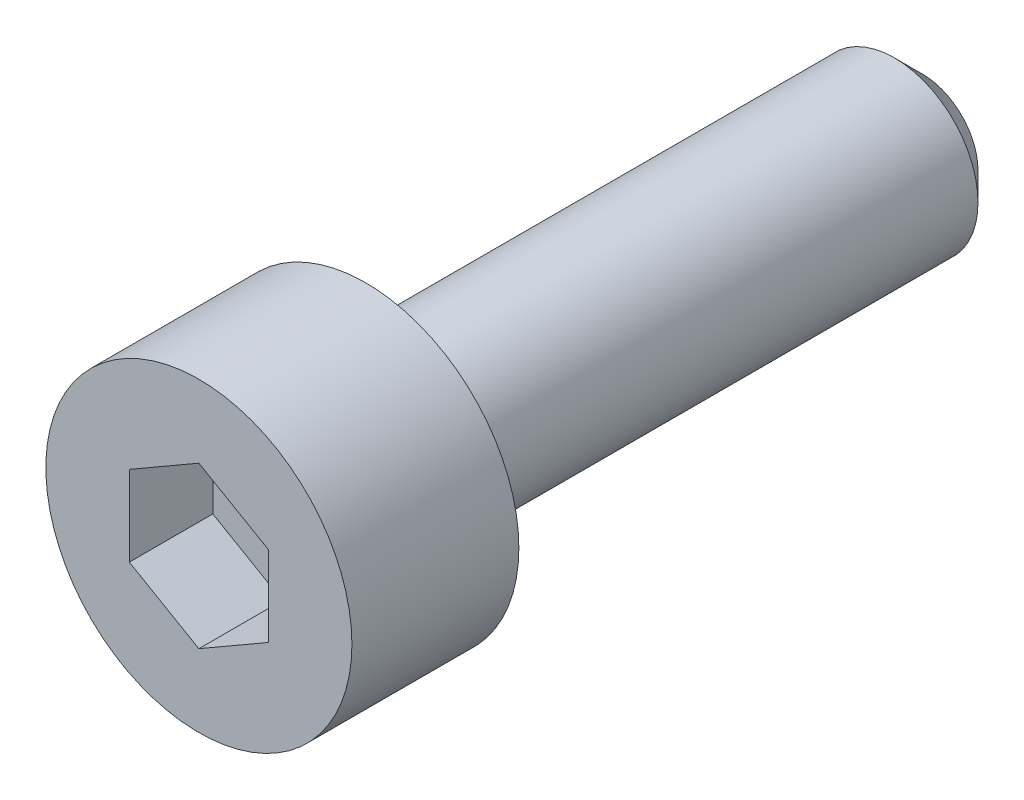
ISO-10303-21;
HEADER;
FILE_DESCRIPTION(('STEP AP214'),'2;1');
FILE_NAME('part.step','',(''),(''),'','','');
FILE_SCHEMA(('AUTOMOTIVE_DESIGN { 1 0 10303 214 1 1 1 1 }'));
ENDSEC;
DATA;
#1=APPLICATION_CONTEXT('core data for automotive mechanical design processes');
#2=APPLICATION_PROTOCOL_DEFINITION('international standard','automotive_design',2000,#1);
#3=PRODUCT_CONTEXT('',#1,'mechanical');
#4=PRODUCT('Part','Part','',(#3));
#5=PRODUCT_RELATED_PRODUCT_CATEGORY('part','',(#4));
#6=PRODUCT_DEFINITION_FORMATION('','',#4);
#7=PRODUCT_DEFINITION_CONTEXT('part definition',#1,'design');
#8=PRODUCT_DEFINITION('design','',#6,#7);
#9=PRODUCT_DEFINITION_SHAPE('','',#8);
#10=(LENGTH_UNIT() NAMED_UNIT(*) SI_UNIT(.MILLI.,.METRE.));
#11=(NAMED_UNIT(*) PLANE_ANGLE_UNIT() SI_UNIT($,.RADIAN.));
#12=(NAMED_UNIT(*) SI_UNIT($,.STERADIAN.) SOLID_ANGLE_UNIT());
#13=UNCERTAINTY_MEASURE_WITH_UNIT(LENGTH_MEASURE(1.E-05),#10,'distance_accuracy_value','');
#14=(GEOMETRIC_REPRESENTATION_CONTEXT(3) GLOBAL_UNCERTAINTY_ASSIGNED_CONTEXT((#13)) GLOBAL_UNIT_ASSIGNED_CONTEXT((#10,
#11,#12)) REPRESENTATION_CONTEXT('',''));
#15=CARTESIAN_POINT('',(0.,0.,0.));
#16=DIRECTION('',(0.,0.,1.));
#17=DIRECTION('',(1.,0.,0.));
#18=AXIS2_PLACEMENT_3D('',#15,#16,#17);
#19=CARTESIAN_POINT('',(0.,1.44337567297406,1.5));
#20=DIRECTION('',(-0.5,-0.866025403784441,0.));
#21=DIRECTION('',(0.866025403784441,-0.5,0.));
#22=AXIS2_PLACEMENT_3D('',#19,#20,#21);
#23=PLANE('',#22);
#24=DIRECTION('',(0.,0.,1.));
#25=VECTOR('',#24,1.);
#26=CARTESIAN_POINT('',(1.25,0.721687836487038,1.5));
#27=LINE('',#26,#25);
#28=CARTESIAN_POINT('',(1.25,0.721687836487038,1.5));
#29=VERTEX_POINT('',#28);
#30=CARTESIAN_POINT('',(1.24999999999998,0.721687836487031,2.99999999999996));
#31=VERTEX_POINT('',#30);
#32=EDGE_CURVE('E63',#29,#31,#27,.T.);
#33=ORIENTED_EDGE('',*,*,#32,.T.);
#34=DIRECTION('',(0.86602540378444,-0.5,0.));
#35=VECTOR('',#34,1.);
#36=CARTESIAN_POINT('',(0.,1.44337567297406,2.99999999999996));
#37=LINE('',#36,#35);
#38=CARTESIAN_POINT('',(0.,1.44337567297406,2.99999999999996));
#39=VERTEX_POINT('',#38);
#40=EDGE_CURVE('E29',#39,#31,#37,.T.);
#41=ORIENTED_EDGE('',*,*,#40,.F.);
#42=DIRECTION('',(0.,0.,1.));
#43=VECTOR('',#42,1.);
#44=CARTESIAN_POINT('',(0.,1.44337567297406,1.5));
#45=LINE('',#44,#43);
#46=CARTESIAN_POINT('',(0.,1.44337567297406,1.5));
#47=VERTEX_POINT('',#46);
#48=EDGE_CURVE('E33',#47,#39,#45,.T.);
#49=ORIENTED_EDGE('',*,*,#48,.F.);
#50=DIRECTION('',(0.86602540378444,-0.5,0.));
#51=VECTOR('',#50,1.);
#52=CARTESIAN_POINT('',(0.,1.44337567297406,1.5));
#53=LINE('',#52,#51);
#54=EDGE_CURVE('E65',#47,#29,#53,.T.);
#55=ORIENTED_EDGE('',*,*,#54,.T.);
#56=EDGE_LOOP('',(#33,#41,#49,#55));
#57=FACE_BOUND('',#56,.T.);
#58=ADVANCED_FACE('F14',(#57),#23,.T.);
#59=CARTESIAN_POINT('',(1.25,-0.721687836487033,1.49999999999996));
#60=DIRECTION('',(1.,0.,0.));
#61=DIRECTION('',(0.,1.,0.));
#62=AXIS2_PLACEMENT_3D('',#59,#60,#61);
#63=PLANE('',#62);
#64=DIRECTION('',(0.,0.,1.));
#65=VECTOR('',#64,1.);
#66=CARTESIAN_POINT('',(1.25,-0.721687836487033,1.49999999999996));
#67=LINE('',#66,#65);
#68=CARTESIAN_POINT('',(1.25,-0.721687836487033,1.49999999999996));
#69=VERTEX_POINT('',#68);
#70=CARTESIAN_POINT('',(1.25,-0.72168783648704,2.99999999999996));
#71=VERTEX_POINT('',#70);
#72=EDGE_CURVE('E70',#69,#71,#67,.T.);
#73=ORIENTED_EDGE('',*,*,#72,.T.);
#74=DIRECTION('',(0.,1.,0.));
#75=VECTOR('',#74,1.);
#76=CARTESIAN_POINT('',(1.25,-0.72168783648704,2.99999999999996));
#77=LINE('',#76,#75);
#78=EDGE_CURVE('E73',#71,#31,#77,.T.);
#79=ORIENTED_EDGE('',*,*,#78,.T.);
#80=ORIENTED_EDGE('',*,*,#32,.F.);
#81=DIRECTION('',(0.,1.,0.));
#82=VECTOR('',#81,1.);
#83=CARTESIAN_POINT('',(1.25,-0.721687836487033,1.49999999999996));
#84=LINE('',#83,#82);
#85=EDGE_CURVE('E100',#69,#29,#84,.T.);
#86=ORIENTED_EDGE('',*,*,#85,.F.);
#87=EDGE_LOOP('',(#73,#79,#80,#86));
#88=FACE_BOUND('',#87,.T.);
#89=ADVANCED_FACE('F74',(#88),#63,.F.);
#90=CARTESIAN_POINT('',(0.,-1.44337567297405,1.49999999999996));
#91=DIRECTION('',(0.5,-0.866025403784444,0.));
#92=DIRECTION('',(0.866025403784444,0.5,0.));
#93=AXIS2_PLACEMENT_3D('',#90,#91,#92);
#94=PLANE('',#93);
#95=DIRECTION('',(0.,0.,1.));
#96=VECTOR('',#95,1.);
#97=CARTESIAN_POINT('',(0.,-1.44337567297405,1.49999999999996));
#98=LINE('',#97,#96);
#99=CARTESIAN_POINT('',(0.,-1.44337567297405,1.49999999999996));
#100=VERTEX_POINT('',#99);
#101=CARTESIAN_POINT('',(0.,-1.44337567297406,2.99999999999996));
#102=VERTEX_POINT('',#101);
#103=EDGE_CURVE('E108',#100,#102,#98,.T.);
#104=ORIENTED_EDGE('',*,*,#103,.T.);
#105=DIRECTION('',(0.866025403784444,0.5,0.));
#106=VECTOR('',#105,1.);
#107=CARTESIAN_POINT('',(0.,-1.44337567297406,2.99999999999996));
#108=LINE('',#107,#106);
#109=EDGE_CURVE('E78',#102,#71,#108,.T.);
#110=ORIENTED_EDGE('',*,*,#109,.T.);
#111=ORIENTED_EDGE('',*,*,#72,.F.);
#112=DIRECTION('',(0.866025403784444,0.5,0.));
#113=VECTOR('',#112,1.);
#114=CARTESIAN_POINT('',(0.,-1.44337567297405,1.49999999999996));
#115=LINE('',#114,#113);
#116=EDGE_CURVE('E97',#100,#69,#115,.T.);
#117=ORIENTED_EDGE('',*,*,#116,.F.);
#118=EDGE_LOOP('',(#104,#110,#111,#117));
#119=FACE_BOUND('',#118,.T.);
#120=ADVANCED_FACE('F139',(#119),#94,.F.);
#121=CARTESIAN_POINT('',(0.,-1.44337567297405,1.49999999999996));
#122=DIRECTION('',(0.5,0.866025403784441,0.));
#123=DIRECTION('',(-0.866025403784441,0.5,0.));
#124=AXIS2_PLACEMENT_3D('',#121,#122,#123);
#125=PLANE('',#124);
#126=DIRECTION('',(0.,0.,1.));
#127=VECTOR('',#126,1.);
#128=CARTESIAN_POINT('',(-1.25,-0.721687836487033,1.49999999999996));
#129=LINE('',#128,#127);
#130=CARTESIAN_POINT('',(-1.25,-0.721687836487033,1.49999999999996));
#131=VERTEX_POINT('',#130);
#132=CARTESIAN_POINT('',(-1.25000000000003,-0.721687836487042,2.99999999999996));
#133=VERTEX_POINT('',#132);
#134=EDGE_CURVE('E106',#131,#133,#129,.T.);
#135=ORIENTED_EDGE('',*,*,#134,.T.);
#136=DIRECTION('',(-0.866025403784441,0.5,0.));
#137=VECTOR('',#136,1.);
#138=CARTESIAN_POINT('',(0.,-1.44337567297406,2.99999999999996));
#139=LINE('',#138,#137);
#140=EDGE_CURVE('E188',#102,#133,#139,.T.);
#141=ORIENTED_EDGE('',*,*,#140,.F.);
#142=ORIENTED_EDGE('',*,*,#103,.F.);
#143=DIRECTION('',(-0.866025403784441,0.5,0.));
#144=VECTOR('',#143,1.);
#145=CARTESIAN_POINT('',(0.,-1.44337567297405,1.49999999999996));
#146=LINE('',#145,#144);
#147=EDGE_CURVE('E94',#100,#131,#146,.T.);
#148=ORIENTED_EDGE('',*,*,#147,.T.);
#149=EDGE_LOOP('',(#135,#141,#142,#148));
#150=FACE_BOUND('',#149,.T.);
#151=ADVANCED_FACE('F151',(#150),#125,.T.);
#152=CARTESIAN_POINT('',(-1.25000000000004,0.721687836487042,1.5));
#153=DIRECTION('',(-1.,0.,0.));
#154=DIRECTION('',(0.,-1.,0.));
#155=AXIS2_PLACEMENT_3D('',#152,#153,#154);
#156=PLANE('',#155);
#157=DIRECTION('',(0.,0.,1.));
#158=VECTOR('',#157,1.);
#159=CARTESIAN_POINT('',(-1.25000000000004,0.721687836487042,1.5));
#160=LINE('',#159,#158);
#161=CARTESIAN_POINT('',(-1.25000000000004,0.721687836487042,1.5));
#162=VERTEX_POINT('',#161);
#163=CARTESIAN_POINT('',(-1.25000000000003,0.721687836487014,2.99999999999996));
#164=VERTEX_POINT('',#163);
#165=EDGE_CURVE('E104',#162,#164,#160,.T.);
#166=ORIENTED_EDGE('',*,*,#165,.T.);
#167=DIRECTION('',(0.,-1.,0.));
#168=VECTOR('',#167,1.);
#169=CARTESIAN_POINT('',(-1.25000000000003,0.721687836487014,2.99999999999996));
#170=LINE('',#169,#168);
#171=EDGE_CURVE('E189',#164,#133,#170,.T.);
#172=ORIENTED_EDGE('',*,*,#171,.T.);
#173=ORIENTED_EDGE('',*,*,#134,.F.);
#174=DIRECTION('',(0.,-1.,0.));
#175=VECTOR('',#174,1.);
#176=CARTESIAN_POINT('',(-1.25000000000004,0.721687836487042,1.5));
#177=LINE('',#176,#175);
#178=EDGE_CURVE('E91',#162,#131,#177,.T.);
#179=ORIENTED_EDGE('',*,*,#178,.F.);
#180=EDGE_LOOP('',(#166,#172,#173,#179));
#181=FACE_BOUND('',#180,.T.);
#182=ADVANCED_FACE('F147',(#181),#156,.F.);
#183=CARTESIAN_POINT('',(0.,1.44337567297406,1.5));
#184=DIRECTION('',(-0.5,0.866025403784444,0.));
#185=DIRECTION('',(-0.866025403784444,-0.5,0.));
#186=AXIS2_PLACEMENT_3D('',#183,#184,#185);
#187=PLANE('',#186);
#188=DIRECTION('',(-0.866025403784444,-0.5,0.));
#189=VECTOR('',#188,1.);
#190=CARTESIAN_POINT('',(0.,1.44337567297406,1.5));
#191=LINE('',#190,#189);
#192=EDGE_CURVE('E88',#47,#162,#191,.T.);
#193=ORIENTED_EDGE('',*,*,#192,.F.);
#194=ORIENTED_EDGE('',*,*,#48,.T.);
#195=DIRECTION('',(-0.866025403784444,-0.5,0.));
#196=VECTOR('',#195,1.);
#197=CARTESIAN_POINT('',(0.,1.44337567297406,2.99999999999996));
#198=LINE('',#197,#196);
#199=EDGE_CURVE('E84',#39,#164,#198,.T.);
#200=ORIENTED_EDGE('',*,*,#199,.T.);
#201=ORIENTED_EDGE('',*,*,#165,.F.);
#202=EDGE_LOOP('',(#193,#194,#200,#201));
#203=FACE_BOUND('',#202,.T.);
#204=ADVANCED_FACE('F144',(#203),#187,.F.);
#205=CARTESIAN_POINT('',(1.25,0.721687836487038,1.5));
#206=DIRECTION('',(0.,0.,1.));
#207=DIRECTION('',(1.,0.,0.));
#208=AXIS2_PLACEMENT_3D('',#205,#206,#207);
#209=PLANE('',#208);
#210=ORIENTED_EDGE('',*,*,#54,.F.);
#211=ORIENTED_EDGE('',*,*,#192,.T.);
#212=ORIENTED_EDGE('',*,*,#178,.T.);
#213=ORIENTED_EDGE('',*,*,#147,.F.);
#214=ORIENTED_EDGE('',*,*,#116,.T.);
#215=ORIENTED_EDGE('',*,*,#85,.T.);
#216=EDGE_LOOP('',(#210,#211,#212,#213,#214,#215));
#217=FACE_BOUND('',#216,.T.);
#218=ADVANCED_FACE('F143',(#217),#209,.T.);
#219=CARTESIAN_POINT('',(0.,0.,2.99999999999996));
#220=DIRECTION('',(0.,0.,1.));
#221=DIRECTION('',(1.,0.,0.));
#222=AXIS2_PLACEMENT_3D('',#219,#220,#221);
#223=PLANE('',#222);
#224=CARTESIAN_POINT('',(0.,0.,2.99999999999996));
#225=DIRECTION('',(0.,0.,1.));
#226=DIRECTION('',(1.,0.,0.));
#227=AXIS2_PLACEMENT_3D('',#224,#225,#226);
#228=CIRCLE('',#227,2.75);
#229=CARTESIAN_POINT('',(2.75,0.,2.99999999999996));
#230=VERTEX_POINT('',#229);
#231=EDGE_CURVE('E116',#230,#230,#228,.T.);
#232=ORIENTED_EDGE('',*,*,#231,.T.);
#233=EDGE_LOOP('',(#232));
#234=FACE_BOUND('',#233,.T.);
#235=ORIENTED_EDGE('',*,*,#199,.F.);
#236=ORIENTED_EDGE('',*,*,#40,.T.);
#237=ORIENTED_EDGE('',*,*,#78,.F.);
#238=ORIENTED_EDGE('',*,*,#109,.F.);
#239=ORIENTED_EDGE('',*,*,#140,.T.);
#240=ORIENTED_EDGE('',*,*,#171,.F.);
#241=EDGE_LOOP('',(#235,#236,#237,#238,#239,#240));
#242=FACE_BOUND('',#241,.T.);
#243=ADVANCED_FACE('F81',(#234,#242),#223,.T.);
#244=CARTESIAN_POINT('',(0.,0.,13.9999999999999));
#245=DIRECTION('',(0.,0.,1.));
#246=DIRECTION('',(1.,0.,0.));
#247=AXIS2_PLACEMENT_3D('',#244,#245,#246);
#248=CYLINDRICAL_SURFACE('',#247,2.75);
#249=CARTESIAN_POINT('',(0.,0.,0.));
#250=DIRECTION('',(0.,0.,1.));
#251=DIRECTION('',(1.,0.,0.));
#252=AXIS2_PLACEMENT_3D('',#249,#250,#251);
#253=CIRCLE('',#252,2.75);
#254=CARTESIAN_POINT('',(2.75,0.,0.));
#255=VERTEX_POINT('',#254);
#256=EDGE_CURVE('E113',#255,#255,#253,.T.);
#257=ORIENTED_EDGE('',*,*,#256,.T.);
#258=EDGE_LOOP('',(#257));
#259=FACE_BOUND('',#258,.T.);
#260=ORIENTED_EDGE('',*,*,#231,.F.);
#261=EDGE_LOOP('',(#260));
#262=FACE_BOUND('',#261,.T.);
#263=ADVANCED_FACE('F165',(#259,#262),#248,.T.);
#264=CARTESIAN_POINT('',(2.75,0.,0.));
#265=DIRECTION('',(0.,0.,-1.));
#266=DIRECTION('',(-1.,0.,0.));
#267=AXIS2_PLACEMENT_3D('',#264,#265,#266);
#268=PLANE('',#267);
#269=CARTESIAN_POINT('',(0.,0.,0.));
#270=DIRECTION('',(0.,0.,1.));
#271=DIRECTION('',(1.,0.,0.));
#272=AXIS2_PLACEMENT_3D('',#269,#270,#271);
#273=CIRCLE('',#272,1.5);
#274=CARTESIAN_POINT('',(1.5,0.,0.));
#275=VERTEX_POINT('',#274);
#276=EDGE_CURVE('E69',#275,#275,#273,.T.);
#277=ORIENTED_EDGE('',*,*,#276,.T.);
#278=EDGE_LOOP('',(#277));
#279=FACE_BOUND('',#278,.T.);
#280=ORIENTED_EDGE('',*,*,#256,.F.);
#281=EDGE_LOOP('',(#280));
#282=FACE_BOUND('',#281,.T.);
#283=ADVANCED_FACE('F161',(#279,#282),#268,.T.);
#284=CARTESIAN_POINT('',(0.,0.,13.9999999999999));
#285=DIRECTION('',(0.,0.,1.));
#286=DIRECTION('',(1.,0.,0.));
#287=AXIS2_PLACEMENT_3D('',#284,#285,#286);
#288=CYLINDRICAL_SURFACE('',#287,1.5);
#289=CARTESIAN_POINT('',(0.,0.,-9.5));
#290=DIRECTION('',(0.,0.,-1.));
#291=DIRECTION('',(-1.,0.,0.));
#292=AXIS2_PLACEMENT_3D('',#289,#290,#291);
#293=CIRCLE('',#292,1.5);
#294=CARTESIAN_POINT('',(-1.50000000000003,0.,-9.5));
#295=VERTEX_POINT('',#294);
#296=EDGE_CURVE('E9',#295,#295,#293,.F.);
#297=ORIENTED_EDGE('',*,*,#296,.T.);
#298=EDGE_LOOP('',(#297));
#299=FACE_BOUND('',#298,.T.);
#300=ORIENTED_EDGE('',*,*,#276,.F.);
#301=EDGE_LOOP('',(#300));
#302=FACE_BOUND('',#301,.T.);
#303=ADVANCED_FACE('F130',(#299,#302),#288,.T.);
#304=CARTESIAN_POINT('',(0.,0.,-10.));
#305=DIRECTION('',(0.,0.,-1.));
#306=DIRECTION('',(0.,1.,0.));
#307=AXIS2_PLACEMENT_3D('',#304,#305,#306);
#308=PLANE('',#307);
#309=CARTESIAN_POINT('',(0.,0.,-10.));
#310=DIRECTION('',(0.,0.,-1.));
#311=DIRECTION('',(0.,1.,0.));
#312=AXIS2_PLACEMENT_3D('',#309,#310,#311);
#313=CIRCLE('',#312,0.999999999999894);
#314=CARTESIAN_POINT('',(0.,0.999999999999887,-10.));
#315=VERTEX_POINT('',#314);
#316=EDGE_CURVE('E22',#315,#315,#313,.T.);
#317=ORIENTED_EDGE('',*,*,#316,.T.);
#318=EDGE_LOOP('',(#317));
#319=FACE_BOUND('',#318,.T.);
#320=ADVANCED_FACE('F121',(#319),#308,.T.);
#321=CARTESIAN_POINT('',(0.,0.,-10.));
#322=DIRECTION('',(0.,0.,1.));
#323=DIRECTION('',(1.,0.,0.));
#324=AXIS2_PLACEMENT_3D('',#321,#322,#323);
#325=CONICAL_SURFACE('',#324,0.999999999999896,0.785398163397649);
#326=ORIENTED_EDGE('',*,*,#296,.F.);
#327=EDGE_LOOP('',(#326));
#328=FACE_BOUND('',#327,.T.);
#329=ORIENTED_EDGE('',*,*,#316,.F.);
#330=EDGE_LOOP('',(#329));
#331=FACE_BOUND('',#330,.T.);
#332=ADVANCED_FACE('F16',(#328,#331),#325,.T.);
#333=CLOSED_SHELL('',(#58,#89,#120,#151,#182,#204,#218,#243,#263,#283,#303,#320,#332));
#334=MANIFOLD_SOLID_BREP('B1',#333);
#335=ADVANCED_BREP_SHAPE_REPRESENTATION('',(#18,#334),#14);
#336=SHAPE_DEFINITION_REPRESENTATION(#9,#335);
ENDSEC;
END-ISO-10303-21;
